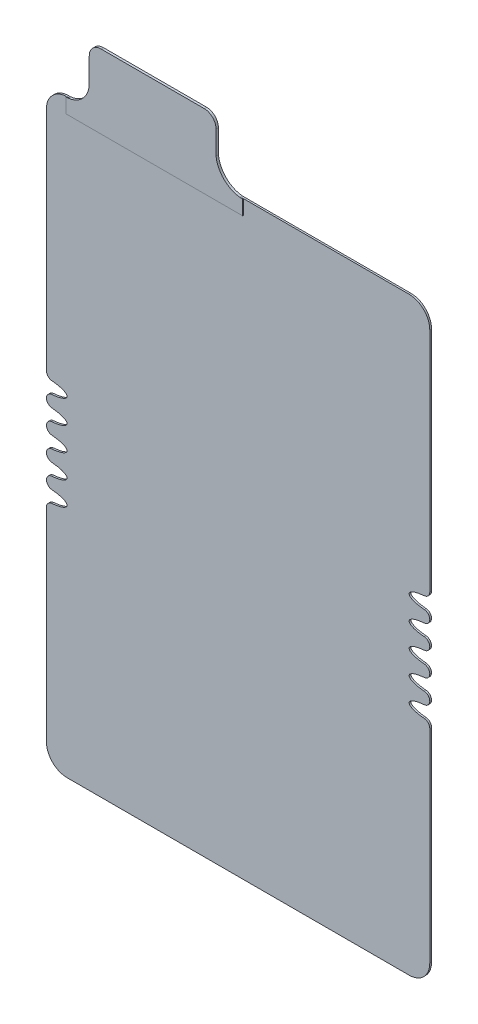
from build123d import *

# Parameters (mm, degrees)
EXTRUDE_1_DEPTH = 0.6
EXTRUDE_2_DEPTH = 0.8


with BuildPart() as part:
    # Sketch 1 → Extrude 1 (new body)
    with BuildSketch(Plane.XY):
        with BuildLine():
            ThreePointArc((63.162295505, -13.978760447), (64.465501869, -13.346350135), (64.99994639, -12))
            ThreePointArc((64.99994639, -12), (64.465501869, -10.653649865), (63.162295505, -10.021239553))
            add(Edge.make_bspline(
                [(63.162295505, -5.978760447), (38.336528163, -8), (63.162295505, -10.021239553)],
                knots=[1.836439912, 1.836439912, 1.836439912, 4.446745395, 4.446745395, 4.446745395], degree=2, weights=[1, 0.262530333, 1]))
            ThreePointArc((63.162295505, -5.978760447), (64.465501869, -5.346350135), (64.99994639, -4))
            ThreePointArc((64.99994639, -4), (64.465501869, -2.653649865), (63.162295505, -2.021239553))
            add(Edge.make_bspline(
                [(63.162295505, 2.021239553), (38.336300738, 0), (63.162295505, -2.021239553)],
                knots=[1.836437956, 1.836437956, 1.836437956, 4.446747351, 4.446747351, 4.446747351], degree=2, weights=[1, 0.262528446, 1]))
            ThreePointArc((63.162295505, 2.021239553), (64.465501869, 2.653649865), (64.99994639, 4))
            ThreePointArc((64.99994639, 4), (64.465501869, 5.346350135), (63.162295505, 5.978760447))
            add(Edge.make_bspline(
                [(63.162295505, 10.021239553), (38.336579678, 8), (63.162295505, 5.978760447)],
                knots=[4.978032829, 4.978032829, 4.978032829, 7.588337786, 7.588337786, 7.588337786], degree=2, weights=[1, 0.262530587, 1]))
            ThreePointArc((63.162295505, 10.021239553), (64.465501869, 10.653649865), (64.99994639, 12))
            ThreePointArc((64.99994639, 12), (64.465501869, 13.346350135), (63.162295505, 13.978760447))
            add(Edge.make_bspline(
                [(63.162295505, 18.021239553), (38.336568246, 16), (63.162295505, 13.978760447)],
                knots=[4.97803277, 4.97803277, 4.97803277, 7.588337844, 7.588337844, 7.588337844], degree=2, weights=[1, 0.262530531, 1]))
            ThreePointArc((63.162295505, 18.021239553), (64.470474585, 18.659024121), (65, 20.01464372))
            Line((65, 20.01464372), (65, 97))
            ThreePointArc((65, 97), (62.949747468, 101.949747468), (58, 104))
            Line((58, 104), (0.797436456, 104))
            ThreePointArc((0.797436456, 104), (1.272825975, 103.962508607), (1.749527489, 103.95))
            Line((1.749527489, 103.95), (1.749527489, 99))
            Line((1.749527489, 99), (-58.250472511, 99))
            Line((-58.250472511, 99), (-58.250472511, 103.95))
            ThreePointArc((-58.250472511, 103.95), (-57.80424522, 103.962509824), (-57.359419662, 104))
            Line((-57.359419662, 104), (-58, 104))
            ThreePointArc((-58, 104), (-62.949747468, 101.949747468), (-65, 97))
            Line((-65, 97), (-65, 20.01464372))
            ThreePointArc((-65, 20.01464372), (-64.470474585, 18.659024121), (-63.162295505, 18.021239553))
            add(Edge.make_bspline(
                [(-63.162295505, 13.978760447), (-38.336504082, 16), (-63.162295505, 18.021239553)],
                knots=[4.978032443, 4.978032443, 4.978032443, 7.588338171, 7.588338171, 7.588338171], degree=2, weights=[1, 0.262530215, 1]))
            ThreePointArc((-63.162295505, 13.978760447), (-64.465501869, 13.346350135), (-64.99994639, 12))
            ThreePointArc((-64.99994639, 12), (-64.465501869, 10.653649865), (-63.162295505, 10.021239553))
            add(Edge.make_bspline(
                [(-63.162295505, 5.978760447), (-38.336526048, 8), (-63.162295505, 10.021239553)],
                knots=[1.836439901, 1.836439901, 1.836439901, 4.446745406, 4.446745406, 4.446745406], degree=2, weights=[1, 0.262530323, 1]))
            ThreePointArc((-63.162295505, 5.978760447), (-64.465501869, 5.346350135), (-64.99994639, 4))
            ThreePointArc((-64.99994639, 4), (-64.465501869, 2.653649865), (-63.162295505, 2.021239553))
            add(Edge.make_bspline(
                [(-63.162295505, -2.021239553), (-38.336540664, 0), (-63.162295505, 2.021239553)],
                knots=[4.97803263, 4.97803263, 4.97803263, 7.588337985, 7.588337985, 7.588337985], degree=2, weights=[1, 0.262530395, 1]))
            ThreePointArc((-63.162295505, -2.021239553), (-64.465501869, -2.653649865), (-64.99994639, -4))
            ThreePointArc((-64.99994639, -4), (-64.465501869, -5.346350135), (-63.162295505, -5.978760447))
            add(Edge.make_bspline(
                [(-63.162295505, -10.021239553), (-38.336475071, -8), (-63.162295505, -5.978760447)],
                knots=[4.978032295, 4.978032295, 4.978032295, 7.58833832, 7.58833832, 7.58833832], degree=2, weights=[1, 0.262530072, 1]))
            ThreePointArc((-63.162295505, -10.021239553), (-64.465501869, -10.653649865), (-64.99994639, -12))
            ThreePointArc((-64.99994639, -12), (-64.465501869, -13.346350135), (-63.162295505, -13.978760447))
            add(Edge.make_bspline(
                [(-63.162295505, -18.021239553), (-38.336548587, -16), (-63.162295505, -13.978760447)],
                knots=[1.836440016, 1.836440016, 1.836440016, 4.446745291, 4.446745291, 4.446745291], degree=2, weights=[1, 0.262530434, 1]))
            ThreePointArc((-63.162295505, -18.021239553), (-64.470474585, -18.659024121), (-65, -20.01464372))
            Line((-65, -20.01464372), (-65, -89))
            ThreePointArc((-65, -89), (-62.949747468, -93.949747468), (-58, -96))
            Line((-58, -96), (58, -96))
            ThreePointArc((58, -96), (62.949747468, -93.949747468), (65, -89))
            Line((65, -89), (65, -20.01464372))
            ThreePointArc((65, -20.01464372), (64.470474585, -18.659024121), (63.162295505, -18.021239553))
            add(Edge.make_bspline(
                [(63.162295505, -13.978760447), (38.336479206, -16), (63.162295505, -18.021239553)],
                knots=[4.978032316, 4.978032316, 4.978032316, 7.588338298, 7.588338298, 7.588338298], degree=2, weights=[1, 0.262530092, 1]))
        make_face()
    extrude(amount=EXTRUDE_1_DEPTH)

    # Sketch 1_3 → Extrude 2 (add)
    with BuildSketch(Plane.XY):
        with BuildLine():
            Line((-46.288182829, 124), (-11.288182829, 124))
            ThreePointArc((-11.288182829, 124), (-8.459755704, 122.828427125), (-7.288182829, 120))
            Line((-7.288182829, 120), (-7.288182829, 112.068294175))
            ThreePointArc((-7.288182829, 112.068294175), (-4.324740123, 106.277580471), (1.749527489, 103.95))
            Line((1.749527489, 103.95), (1.749527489, 99))
            Line((1.749527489, 99), (-58.250472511, 99))
            Line((-58.250472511, 99), (-58.250472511, 103.95))
            ThreePointArc((-58.250472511, 103.95), (-52.548959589, 106.353275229), (-50.288182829, 112.112777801))
            Line((-50.288182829, 112.112777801), (-50.288182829, 120))
            ThreePointArc((-50.288182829, 120), (-49.116609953, 122.828427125), (-46.288182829, 124))
        make_face()
    extrude(amount=EXTRUDE_2_DEPTH)


solid = part.part
